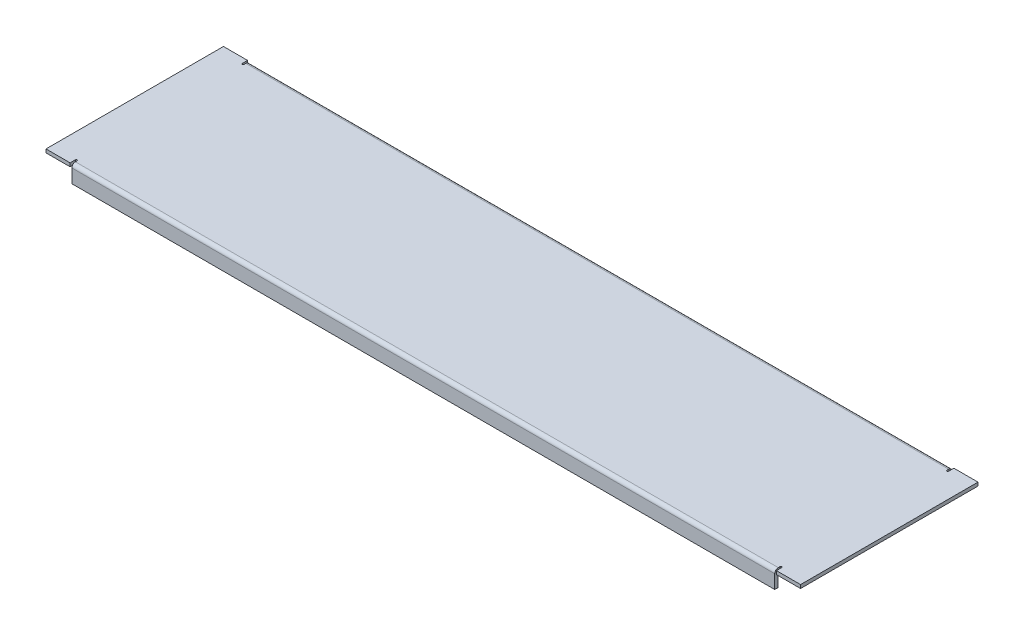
ISO-10303-21;
HEADER;
FILE_DESCRIPTION(('STEP AP214'),'2;1');
FILE_NAME('part.step','',(''),(''),'','','');
FILE_SCHEMA(('AUTOMOTIVE_DESIGN { 1 0 10303 214 1 1 1 1 }'));
ENDSEC;
DATA;
#1=APPLICATION_CONTEXT('core data for automotive mechanical design processes');
#2=APPLICATION_PROTOCOL_DEFINITION('international standard','automotive_design',2000,#1);
#3=PRODUCT_CONTEXT('',#1,'mechanical');
#4=PRODUCT('Part','Part','',(#3));
#5=PRODUCT_RELATED_PRODUCT_CATEGORY('part','',(#4));
#6=PRODUCT_DEFINITION_FORMATION('','',#4);
#7=PRODUCT_DEFINITION_CONTEXT('part definition',#1,'design');
#8=PRODUCT_DEFINITION('design','',#6,#7);
#9=PRODUCT_DEFINITION_SHAPE('','',#8);
#10=(LENGTH_UNIT() NAMED_UNIT(*) SI_UNIT(.MILLI.,.METRE.));
#11=(NAMED_UNIT(*) PLANE_ANGLE_UNIT() SI_UNIT($,.RADIAN.));
#12=(NAMED_UNIT(*) SI_UNIT($,.STERADIAN.) SOLID_ANGLE_UNIT());
#13=UNCERTAINTY_MEASURE_WITH_UNIT(LENGTH_MEASURE(1.E-05),#10,'distance_accuracy_value','');
#14=(GEOMETRIC_REPRESENTATION_CONTEXT(3) GLOBAL_UNCERTAINTY_ASSIGNED_CONTEXT((#13)) GLOBAL_UNIT_ASSIGNED_CONTEXT((#10,
#11,#12)) REPRESENTATION_CONTEXT('',''));
#15=CARTESIAN_POINT('',(0.,0.,0.));
#16=DIRECTION('',(0.,0.,1.));
#17=DIRECTION('',(1.,0.,0.));
#18=AXIS2_PLACEMENT_3D('',#15,#16,#17);
#19=CARTESIAN_POINT('',(219.,2.,-51.5));
#20=DIRECTION('',(0.,-1.,0.));
#21=DIRECTION('',(0.,0.,-1.));
#22=AXIS2_PLACEMENT_3D('',#19,#20,#21);
#23=PLANE('',#22);
#24=DIRECTION('',(0.,0.,-1.));
#25=VECTOR('',#24,1.);
#26=CARTESIAN_POINT('',(205.,2.,-51.5));
#27=LINE('',#26,#25);
#28=CARTESIAN_POINT('',(205.,2.,-48.45));
#29=VERTEX_POINT('',#28);
#30=CARTESIAN_POINT('',(205.,2.,-51.5));
#31=VERTEX_POINT('',#30);
#32=EDGE_CURVE('E89',#29,#31,#27,.T.);
#33=ORIENTED_EDGE('',*,*,#32,.F.);
#34=CARTESIAN_POINT('',(204.5,2.,-48.45));
#35=DIRECTION('',(0.,-1.,0.));
#36=DIRECTION('',(0.,0.,-1.));
#37=AXIS2_PLACEMENT_3D('',#34,#35,#36);
#38=CIRCLE('',#37,0.5);
#39=CARTESIAN_POINT('',(204.,2.,-48.45));
#40=VERTEX_POINT('',#39);
#41=EDGE_CURVE('E93',#40,#29,#38,.F.);
#42=ORIENTED_EDGE('',*,*,#41,.F.);
#43=DIRECTION('',(0.,0.,1.));
#44=VECTOR('',#43,1.);
#45=CARTESIAN_POINT('',(204.,2.,-51.5));
#46=LINE('',#45,#44);
#47=CARTESIAN_POINT('',(204.,2.00000000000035,-49.45));
#48=VERTEX_POINT('',#47);
#49=EDGE_CURVE('E373',#48,#40,#46,.T.);
#50=ORIENTED_EDGE('',*,*,#49,.F.);
#51=DIRECTION('',(1.,0.,0.));
#52=VECTOR('',#51,1.);
#53=CARTESIAN_POINT('',(204.,2.00000000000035,-49.45));
#54=LINE('',#53,#52);
#55=CARTESIAN_POINT('',(-204.,2.,-49.45));
#56=VERTEX_POINT('',#55);
#57=EDGE_CURVE('E266',#48,#56,#54,.F.);
#58=ORIENTED_EDGE('',*,*,#57,.T.);
#59=DIRECTION('',(0.,0.,-1.));
#60=VECTOR('',#59,1.);
#61=CARTESIAN_POINT('',(-204.,2.,-51.5));
#62=LINE('',#61,#60);
#63=CARTESIAN_POINT('',(-204.,2.,-48.45));
#64=VERTEX_POINT('',#63);
#65=EDGE_CURVE('E370',#64,#56,#62,.T.);
#66=ORIENTED_EDGE('',*,*,#65,.F.);
#67=CARTESIAN_POINT('',(-204.5,2.,-48.45));
#68=DIRECTION('',(0.,-1.,0.));
#69=DIRECTION('',(0.,0.,-1.));
#70=AXIS2_PLACEMENT_3D('',#67,#68,#69);
#71=CIRCLE('',#70,0.5);
#72=CARTESIAN_POINT('',(-205.,2.,-48.45));
#73=VERTEX_POINT('',#72);
#74=EDGE_CURVE('E367',#73,#64,#71,.F.);
#75=ORIENTED_EDGE('',*,*,#74,.F.);
#76=DIRECTION('',(0.,0.,1.));
#77=VECTOR('',#76,1.);
#78=CARTESIAN_POINT('',(-205.,2.,-51.5));
#79=LINE('',#78,#77);
#80=CARTESIAN_POINT('',(-205.,2.,-51.5));
#81=VERTEX_POINT('',#80);
#82=EDGE_CURVE('E332',#81,#73,#79,.T.);
#83=ORIENTED_EDGE('',*,*,#82,.F.);
#84=DIRECTION('',(-1.,0.,0.));
#85=VECTOR('',#84,1.);
#86=CARTESIAN_POINT('',(-219.,2.,-51.5));
#87=LINE('',#86,#85);
#88=CARTESIAN_POINT('',(-219.,2.,-51.5));
#89=VERTEX_POINT('',#88);
#90=EDGE_CURVE('E480',#81,#89,#87,.T.);
#91=ORIENTED_EDGE('',*,*,#90,.T.);
#92=DIRECTION('',(0.,0.,1.));
#93=VECTOR('',#92,1.);
#94=CARTESIAN_POINT('',(-219.,2.,51.5));
#95=LINE('',#94,#93);
#96=CARTESIAN_POINT('',(-219.,2.,51.5));
#97=VERTEX_POINT('',#96);
#98=EDGE_CURVE('E484',#89,#97,#95,.T.);
#99=ORIENTED_EDGE('',*,*,#98,.T.);
#100=DIRECTION('',(1.,0.,0.));
#101=VECTOR('',#100,1.);
#102=CARTESIAN_POINT('',(-219.,2.,51.5));
#103=LINE('',#102,#101);
#104=CARTESIAN_POINT('',(-205.,2.,51.5));
#105=VERTEX_POINT('',#104);
#106=EDGE_CURVE('E487',#97,#105,#103,.T.);
#107=ORIENTED_EDGE('',*,*,#106,.T.);
#108=DIRECTION('',(0.,0.,1.));
#109=VECTOR('',#108,1.);
#110=CARTESIAN_POINT('',(-205.,2.,-51.5));
#111=LINE('',#110,#109);
#112=CARTESIAN_POINT('',(-205.,2.,48.45));
#113=VERTEX_POINT('',#112);
#114=EDGE_CURVE('E474',#113,#105,#111,.T.);
#115=ORIENTED_EDGE('',*,*,#114,.F.);
#116=CARTESIAN_POINT('',(-204.5,2.,48.45));
#117=DIRECTION('',(0.,-1.,0.));
#118=DIRECTION('',(0.,0.,-1.));
#119=AXIS2_PLACEMENT_3D('',#116,#117,#118);
#120=CIRCLE('',#119,0.5);
#121=CARTESIAN_POINT('',(-204.,2.,48.45));
#122=VERTEX_POINT('',#121);
#123=EDGE_CURVE('E472',#122,#113,#120,.F.);
#124=ORIENTED_EDGE('',*,*,#123,.F.);
#125=DIRECTION('',(0.,0.,-1.));
#126=VECTOR('',#125,1.);
#127=CARTESIAN_POINT('',(-204.,2.,-51.5));
#128=LINE('',#127,#126);
#129=CARTESIAN_POINT('',(-204.,2.,49.45));
#130=VERTEX_POINT('',#129);
#131=EDGE_CURVE('E470',#130,#122,#128,.T.);
#132=ORIENTED_EDGE('',*,*,#131,.F.);
#133=DIRECTION('',(-1.,0.,0.));
#134=VECTOR('',#133,1.);
#135=CARTESIAN_POINT('',(-204.,2.,49.45));
#136=LINE('',#135,#134);
#137=CARTESIAN_POINT('',(204.,2.,49.45));
#138=VERTEX_POINT('',#137);
#139=EDGE_CURVE('E409',#130,#138,#136,.F.);
#140=ORIENTED_EDGE('',*,*,#139,.T.);
#141=DIRECTION('',(0.,0.,1.));
#142=VECTOR('',#141,1.);
#143=CARTESIAN_POINT('',(204.,2.,-51.5));
#144=LINE('',#143,#142);
#145=CARTESIAN_POINT('',(204.,2.,48.45));
#146=VERTEX_POINT('',#145);
#147=EDGE_CURVE('E468',#146,#138,#144,.T.);
#148=ORIENTED_EDGE('',*,*,#147,.F.);
#149=CARTESIAN_POINT('',(204.5,2.,48.45));
#150=DIRECTION('',(0.,-1.,0.));
#151=DIRECTION('',(0.,0.,-1.));
#152=AXIS2_PLACEMENT_3D('',#149,#150,#151);
#153=CIRCLE('',#152,0.5);
#154=CARTESIAN_POINT('',(205.,2.,48.45));
#155=VERTEX_POINT('',#154);
#156=EDGE_CURVE('E466',#155,#146,#153,.F.);
#157=ORIENTED_EDGE('',*,*,#156,.F.);
#158=DIRECTION('',(0.,0.,-1.));
#159=VECTOR('',#158,1.);
#160=CARTESIAN_POINT('',(205.,2.,-51.5));
#161=LINE('',#160,#159);
#162=CARTESIAN_POINT('',(205.,2.,51.5));
#163=VERTEX_POINT('',#162);
#164=EDGE_CURVE('E436',#163,#155,#161,.T.);
#165=ORIENTED_EDGE('',*,*,#164,.F.);
#166=CARTESIAN_POINT('',(219.,2.,51.5));
#167=VERTEX_POINT('',#166);
#168=EDGE_CURVE('E486',#163,#167,#103,.T.);
#169=ORIENTED_EDGE('',*,*,#168,.T.);
#170=DIRECTION('',(0.,0.,-1.));
#171=VECTOR('',#170,1.);
#172=CARTESIAN_POINT('',(219.,2.,51.5));
#173=LINE('',#172,#171);
#174=CARTESIAN_POINT('',(219.,2.,-51.5));
#175=VERTEX_POINT('',#174);
#176=EDGE_CURVE('E477',#167,#175,#173,.T.);
#177=ORIENTED_EDGE('',*,*,#176,.T.);
#178=EDGE_CURVE('E482',#175,#31,#87,.T.);
#179=ORIENTED_EDGE('',*,*,#178,.T.);
#180=EDGE_LOOP('',(#33,#42,#50,#58,#66,#75,#83,#91,#99,#107,#115,#124,#132,#140,#148,#157,#165,
#169,#177,#179));
#181=FACE_BOUND('',#180,.T.);
#182=ADVANCED_FACE('F74',(#181),#23,.F.);
#183=CARTESIAN_POINT('',(219.,0.,-51.5));
#184=DIRECTION('',(0.,-1.,0.));
#185=DIRECTION('',(0.,0.,-1.));
#186=AXIS2_PLACEMENT_3D('',#183,#184,#185);
#187=PLANE('',#186);
#188=CARTESIAN_POINT('',(204.5,3.53531223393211E-13,-48.45));
#189=DIRECTION('',(0.,-1.,0.));
#190=DIRECTION('',(0.,0.,-1.));
#191=AXIS2_PLACEMENT_3D('',#188,#189,#190);
#192=CIRCLE('',#191,0.5);
#193=CARTESIAN_POINT('',(205.,0.,-48.45));
#194=VERTEX_POINT('',#193);
#195=CARTESIAN_POINT('',(204.,0.,-48.45));
#196=VERTEX_POINT('',#195);
#197=EDGE_CURVE('E334',#194,#196,#192,.T.);
#198=ORIENTED_EDGE('',*,*,#197,.F.);
#199=DIRECTION('',(0.,0.,1.));
#200=VECTOR('',#199,1.);
#201=CARTESIAN_POINT('',(205.,1.76765611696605E-13,-51.5));
#202=LINE('',#201,#200);
#203=CARTESIAN_POINT('',(205.,0.,-51.5));
#204=VERTEX_POINT('',#203);
#205=EDGE_CURVE('E329',#204,#194,#202,.T.);
#206=ORIENTED_EDGE('',*,*,#205,.F.);
#207=DIRECTION('',(-1.,0.,0.));
#208=VECTOR('',#207,1.);
#209=CARTESIAN_POINT('',(-219.,0.,-51.5));
#210=LINE('',#209,#208);
#211=CARTESIAN_POINT('',(219.,0.,-51.5));
#212=VERTEX_POINT('',#211);
#213=EDGE_CURVE('E494',#212,#204,#210,.T.);
#214=ORIENTED_EDGE('',*,*,#213,.F.);
#215=DIRECTION('',(0.,0.,-1.));
#216=VECTOR('',#215,1.);
#217=CARTESIAN_POINT('',(219.,0.,51.5));
#218=LINE('',#217,#216);
#219=CARTESIAN_POINT('',(219.,0.,51.5));
#220=VERTEX_POINT('',#219);
#221=EDGE_CURVE('E476',#220,#212,#218,.T.);
#222=ORIENTED_EDGE('',*,*,#221,.F.);
#223=DIRECTION('',(1.,0.,0.));
#224=VECTOR('',#223,1.);
#225=CARTESIAN_POINT('',(-219.,0.,51.5));
#226=LINE('',#225,#224);
#227=CARTESIAN_POINT('',(205.,0.,51.5));
#228=VERTEX_POINT('',#227);
#229=EDGE_CURVE('E499',#228,#220,#226,.T.);
#230=ORIENTED_EDGE('',*,*,#229,.F.);
#231=DIRECTION('',(0.,0.,1.));
#232=VECTOR('',#231,1.);
#233=CARTESIAN_POINT('',(205.,0.,48.45));
#234=LINE('',#233,#232);
#235=CARTESIAN_POINT('',(205.,0.,48.45));
#236=VERTEX_POINT('',#235);
#237=EDGE_CURVE('E451',#236,#228,#234,.T.);
#238=ORIENTED_EDGE('',*,*,#237,.F.);
#239=CARTESIAN_POINT('',(204.5,0.,48.45));
#240=DIRECTION('',(0.,-1.,0.));
#241=DIRECTION('',(0.,0.,-1.));
#242=AXIS2_PLACEMENT_3D('',#239,#240,#241);
#243=CIRCLE('',#242,0.5);
#244=CARTESIAN_POINT('',(204.,0.,48.45));
#245=VERTEX_POINT('',#244);
#246=EDGE_CURVE('E448',#245,#236,#243,.T.);
#247=ORIENTED_EDGE('',*,*,#246,.F.);
#248=DIRECTION('',(0.,0.,-1.));
#249=VECTOR('',#248,1.);
#250=CARTESIAN_POINT('',(204.,0.,49.45));
#251=LINE('',#250,#249);
#252=CARTESIAN_POINT('',(204.,0.,49.45));
#253=VERTEX_POINT('',#252);
#254=EDGE_CURVE('E445',#253,#245,#251,.T.);
#255=ORIENTED_EDGE('',*,*,#254,.F.);
#256=DIRECTION('',(-1.,0.,0.));
#257=VECTOR('',#256,1.);
#258=CARTESIAN_POINT('',(-204.,0.,49.45));
#259=LINE('',#258,#257);
#260=CARTESIAN_POINT('',(-204.,0.,49.45));
#261=VERTEX_POINT('',#260);
#262=EDGE_CURVE('E422',#261,#253,#259,.F.);
#263=ORIENTED_EDGE('',*,*,#262,.F.);
#264=DIRECTION('',(0.,0.,1.));
#265=VECTOR('',#264,1.);
#266=CARTESIAN_POINT('',(-204.,0.,48.45));
#267=LINE('',#266,#265);
#268=CARTESIAN_POINT('',(-204.,0.,48.45));
#269=VERTEX_POINT('',#268);
#270=EDGE_CURVE('E442',#269,#261,#267,.T.);
#271=ORIENTED_EDGE('',*,*,#270,.F.);
#272=CARTESIAN_POINT('',(-204.5,0.,48.45));
#273=DIRECTION('',(0.,-1.,0.));
#274=DIRECTION('',(0.,0.,-1.));
#275=AXIS2_PLACEMENT_3D('',#272,#273,#274);
#276=CIRCLE('',#275,0.5);
#277=CARTESIAN_POINT('',(-205.,0.,48.45));
#278=VERTEX_POINT('',#277);
#279=EDGE_CURVE('E438',#278,#269,#276,.T.);
#280=ORIENTED_EDGE('',*,*,#279,.F.);
#281=DIRECTION('',(0.,0.,-1.));
#282=VECTOR('',#281,1.);
#283=CARTESIAN_POINT('',(-205.,0.,51.5));
#284=LINE('',#283,#282);
#285=CARTESIAN_POINT('',(-205.,0.,51.5));
#286=VERTEX_POINT('',#285);
#287=EDGE_CURVE('E433',#286,#278,#284,.T.);
#288=ORIENTED_EDGE('',*,*,#287,.F.);
#289=CARTESIAN_POINT('',(-219.,0.,51.5));
#290=VERTEX_POINT('',#289);
#291=EDGE_CURVE('E481',#290,#286,#226,.T.);
#292=ORIENTED_EDGE('',*,*,#291,.F.);
#293=DIRECTION('',(0.,0.,1.));
#294=VECTOR('',#293,1.);
#295=CARTESIAN_POINT('',(-219.,0.,51.5));
#296=LINE('',#295,#294);
#297=CARTESIAN_POINT('',(-219.,0.,-51.5));
#298=VERTEX_POINT('',#297);
#299=EDGE_CURVE('E497',#298,#290,#296,.T.);
#300=ORIENTED_EDGE('',*,*,#299,.F.);
#301=CARTESIAN_POINT('',(-205.,0.,-51.5));
#302=VERTEX_POINT('',#301);
#303=EDGE_CURVE('E493',#302,#298,#210,.T.);
#304=ORIENTED_EDGE('',*,*,#303,.F.);
#305=DIRECTION('',(0.,0.,-1.));
#306=VECTOR('',#305,1.);
#307=CARTESIAN_POINT('',(-205.,3.53531223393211E-13,-48.45));
#308=LINE('',#307,#306);
#309=CARTESIAN_POINT('',(-205.,0.,-48.45));
#310=VERTEX_POINT('',#309);
#311=EDGE_CURVE('E349',#310,#302,#308,.T.);
#312=ORIENTED_EDGE('',*,*,#311,.F.);
#313=CARTESIAN_POINT('',(-204.5,3.53531223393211E-13,-48.45));
#314=DIRECTION('',(0.,-1.,0.));
#315=DIRECTION('',(0.,0.,-1.));
#316=AXIS2_PLACEMENT_3D('',#313,#314,#315);
#317=CIRCLE('',#316,0.5);
#318=CARTESIAN_POINT('',(-204.,0.,-48.45));
#319=VERTEX_POINT('',#318);
#320=EDGE_CURVE('E345',#319,#310,#317,.T.);
#321=ORIENTED_EDGE('',*,*,#320,.F.);
#322=DIRECTION('',(0.,0.,1.));
#323=VECTOR('',#322,1.);
#324=CARTESIAN_POINT('',(-204.,3.53531223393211E-13,-49.45));
#325=LINE('',#324,#323);
#326=CARTESIAN_POINT('',(-204.,0.,-49.45));
#327=VERTEX_POINT('',#326);
#328=EDGE_CURVE('E342',#327,#319,#325,.T.);
#329=ORIENTED_EDGE('',*,*,#328,.F.);
#330=DIRECTION('',(1.,0.,0.));
#331=VECTOR('',#330,1.);
#332=CARTESIAN_POINT('',(204.,3.53531223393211E-13,-49.45));
#333=LINE('',#332,#331);
#334=CARTESIAN_POINT('',(204.,0.,-49.45));
#335=VERTEX_POINT('',#334);
#336=EDGE_CURVE('E320',#335,#327,#333,.F.);
#337=ORIENTED_EDGE('',*,*,#336,.F.);
#338=DIRECTION('',(0.,0.,-1.));
#339=VECTOR('',#338,1.);
#340=CARTESIAN_POINT('',(204.,3.53531223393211E-13,-48.45));
#341=LINE('',#340,#339);
#342=EDGE_CURVE('E338',#196,#335,#341,.T.);
#343=ORIENTED_EDGE('',*,*,#342,.F.);
#344=EDGE_LOOP('',(#198,#206,#214,#222,#230,#238,#247,#255,#263,#271,#280,#288,#292,#300,#304,
#312,#321,#329,#337,#343));
#345=FACE_BOUND('',#344,.T.);
#346=ADVANCED_FACE('F517',(#345),#187,.T.);
#347=CARTESIAN_POINT('',(-219.,2.,-51.5));
#348=DIRECTION('',(0.,0.,1.));
#349=DIRECTION('',(1.,0.,0.));
#350=AXIS2_PLACEMENT_3D('',#347,#348,#349);
#351=PLANE('',#350);
#352=DIRECTION('',(0.,1.,0.));
#353=VECTOR('',#352,1.);
#354=CARTESIAN_POINT('',(205.,1.76765611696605E-13,-51.5));
#355=LINE('',#354,#353);
#356=EDGE_CURVE('E333',#204,#31,#355,.T.);
#357=ORIENTED_EDGE('',*,*,#356,.T.);
#358=ORIENTED_EDGE('',*,*,#178,.F.);
#359=DIRECTION('',(0.,-1.,0.));
#360=VECTOR('',#359,1.);
#361=CARTESIAN_POINT('',(219.,2.,-51.5));
#362=LINE('',#361,#360);
#363=EDGE_CURVE('E13',#175,#212,#362,.T.);
#364=ORIENTED_EDGE('',*,*,#363,.T.);
#365=ORIENTED_EDGE('',*,*,#213,.T.);
#366=EDGE_LOOP('',(#357,#358,#364,#365));
#367=FACE_BOUND('',#366,.T.);
#368=ADVANCED_FACE('F564',(#367),#351,.F.);
#369=DIRECTION('',(0.,1.,0.));
#370=VECTOR('',#369,1.);
#371=CARTESIAN_POINT('',(-205.,1.76765611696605E-13,-51.5));
#372=LINE('',#371,#370);
#373=EDGE_CURVE('E352',#302,#81,#372,.T.);
#374=ORIENTED_EDGE('',*,*,#373,.F.);
#375=ORIENTED_EDGE('',*,*,#303,.T.);
#376=DIRECTION('',(0.,-1.,0.));
#377=VECTOR('',#376,1.);
#378=CARTESIAN_POINT('',(-219.,2.,-51.5));
#379=LINE('',#378,#377);
#380=EDGE_CURVE('E82',#89,#298,#379,.T.);
#381=ORIENTED_EDGE('',*,*,#380,.F.);
#382=ORIENTED_EDGE('',*,*,#90,.F.);
#383=EDGE_LOOP('',(#374,#375,#381,#382));
#384=FACE_BOUND('',#383,.T.);
#385=ADVANCED_FACE('F526',(#384),#351,.F.);
#386=CARTESIAN_POINT('',(-219.,2.,51.5));
#387=DIRECTION('',(0.,0.,-1.));
#388=DIRECTION('',(-1.,0.,0.));
#389=AXIS2_PLACEMENT_3D('',#386,#387,#388);
#390=PLANE('',#389);
#391=DIRECTION('',(0.,1.,0.));
#392=VECTOR('',#391,1.);
#393=CARTESIAN_POINT('',(-205.,0.,51.5));
#394=LINE('',#393,#392);
#395=EDGE_CURVE('E437',#286,#105,#394,.T.);
#396=ORIENTED_EDGE('',*,*,#395,.T.);
#397=ORIENTED_EDGE('',*,*,#106,.F.);
#398=DIRECTION('',(0.,-1.,0.));
#399=VECTOR('',#398,1.);
#400=CARTESIAN_POINT('',(-219.,2.,51.5));
#401=LINE('',#400,#399);
#402=EDGE_CURVE('E504',#97,#290,#401,.T.);
#403=ORIENTED_EDGE('',*,*,#402,.T.);
#404=ORIENTED_EDGE('',*,*,#291,.T.);
#405=EDGE_LOOP('',(#396,#397,#403,#404));
#406=FACE_BOUND('',#405,.T.);
#407=ADVANCED_FACE('F521',(#406),#390,.F.);
#408=DIRECTION('',(0.,1.,0.));
#409=VECTOR('',#408,1.);
#410=CARTESIAN_POINT('',(205.,0.,51.5));
#411=LINE('',#410,#409);
#412=EDGE_CURVE('E453',#228,#163,#411,.T.);
#413=ORIENTED_EDGE('',*,*,#412,.F.);
#414=ORIENTED_EDGE('',*,*,#229,.T.);
#415=DIRECTION('',(0.,-1.,0.));
#416=VECTOR('',#415,1.);
#417=CARTESIAN_POINT('',(219.,2.,51.5));
#418=LINE('',#417,#416);
#419=EDGE_CURVE('E490',#167,#220,#418,.T.);
#420=ORIENTED_EDGE('',*,*,#419,.F.);
#421=ORIENTED_EDGE('',*,*,#168,.F.);
#422=EDGE_LOOP('',(#413,#414,#420,#421));
#423=FACE_BOUND('',#422,.T.);
#424=ADVANCED_FACE('F572',(#423),#390,.F.);
#425=CARTESIAN_POINT('',(219.,2.,51.5));
#426=DIRECTION('',(-1.,0.,0.));
#427=DIRECTION('',(0.,0.,1.));
#428=AXIS2_PLACEMENT_3D('',#425,#426,#427);
#429=PLANE('',#428);
#430=ORIENTED_EDGE('',*,*,#221,.T.);
#431=ORIENTED_EDGE('',*,*,#363,.F.);
#432=ORIENTED_EDGE('',*,*,#176,.F.);
#433=ORIENTED_EDGE('',*,*,#419,.T.);
#434=EDGE_LOOP('',(#430,#431,#432,#433));
#435=FACE_BOUND('',#434,.T.);
#436=ADVANCED_FACE('F76',(#435),#429,.F.);
#437=CARTESIAN_POINT('',(-219.,2.,51.5));
#438=DIRECTION('',(1.,0.,0.));
#439=DIRECTION('',(0.,0.,-1.));
#440=AXIS2_PLACEMENT_3D('',#437,#438,#439);
#441=PLANE('',#440);
#442=ORIENTED_EDGE('',*,*,#299,.T.);
#443=ORIENTED_EDGE('',*,*,#402,.F.);
#444=ORIENTED_EDGE('',*,*,#98,.F.);
#445=ORIENTED_EDGE('',*,*,#380,.T.);
#446=EDGE_LOOP('',(#442,#443,#444,#445));
#447=FACE_BOUND('',#446,.T.);
#448=ADVANCED_FACE('F511',(#447),#441,.F.);
#449=CARTESIAN_POINT('',(-205.,0.,51.5));
#450=DIRECTION('',(1.,0.,0.));
#451=DIRECTION('',(0.,0.,-1.));
#452=AXIS2_PLACEMENT_3D('',#449,#450,#451);
#453=PLANE('',#452);
#454=DIRECTION('',(0.,1.,0.));
#455=VECTOR('',#454,1.);
#456=CARTESIAN_POINT('',(-205.,0.,48.45));
#457=LINE('',#456,#455);
#458=EDGE_CURVE('E441',#278,#113,#457,.T.);
#459=ORIENTED_EDGE('',*,*,#458,.T.);
#460=ORIENTED_EDGE('',*,*,#114,.T.);
#461=ORIENTED_EDGE('',*,*,#395,.F.);
#462=ORIENTED_EDGE('',*,*,#287,.T.);
#463=EDGE_LOOP('',(#459,#460,#461,#462));
#464=FACE_BOUND('',#463,.T.);
#465=ADVANCED_FACE('F567',(#464),#453,.T.);
#466=CARTESIAN_POINT('',(-204.5,0.,48.45));
#467=DIRECTION('',(0.,1.,0.));
#468=DIRECTION('',(0.,0.,1.));
#469=AXIS2_PLACEMENT_3D('',#466,#467,#468);
#470=CYLINDRICAL_SURFACE('',#469,0.5);
#471=DIRECTION('',(0.,1.,0.));
#472=VECTOR('',#471,1.);
#473=CARTESIAN_POINT('',(-204.,0.,48.45));
#474=LINE('',#473,#472);
#475=EDGE_CURVE('E444',#269,#122,#474,.T.);
#476=ORIENTED_EDGE('',*,*,#475,.T.);
#477=ORIENTED_EDGE('',*,*,#123,.T.);
#478=ORIENTED_EDGE('',*,*,#458,.F.);
#479=ORIENTED_EDGE('',*,*,#279,.T.);
#480=EDGE_LOOP('',(#476,#477,#478,#479));
#481=FACE_BOUND('',#480,.T.);
#482=ADVANCED_FACE('F665',(#481),#470,.F.);
#483=CARTESIAN_POINT('',(-204.,0.,48.45));
#484=DIRECTION('',(-1.,0.,0.));
#485=DIRECTION('',(0.,0.,1.));
#486=AXIS2_PLACEMENT_3D('',#483,#484,#485);
#487=PLANE('',#486);
#488=DIRECTION('',(0.,1.,0.));
#489=VECTOR('',#488,1.);
#490=CARTESIAN_POINT('',(-204.,0.,49.45));
#491=LINE('',#490,#489);
#492=EDGE_CURVE('E416',#261,#130,#491,.T.);
#493=ORIENTED_EDGE('',*,*,#492,.T.);
#494=ORIENTED_EDGE('',*,*,#131,.T.);
#495=ORIENTED_EDGE('',*,*,#475,.F.);
#496=ORIENTED_EDGE('',*,*,#270,.T.);
#497=EDGE_LOOP('',(#493,#494,#495,#496));
#498=FACE_BOUND('',#497,.T.);
#499=ADVANCED_FACE('F641',(#498),#487,.T.);
#500=CARTESIAN_POINT('',(204.,0.,49.45));
#501=DIRECTION('',(1.,0.,0.));
#502=DIRECTION('',(0.,0.,-1.));
#503=AXIS2_PLACEMENT_3D('',#500,#501,#502);
#504=PLANE('',#503);
#505=DIRECTION('',(0.,1.,0.));
#506=VECTOR('',#505,1.);
#507=CARTESIAN_POINT('',(204.,0.,48.45));
#508=LINE('',#507,#506);
#509=EDGE_CURVE('E450',#245,#146,#508,.T.);
#510=ORIENTED_EDGE('',*,*,#509,.T.);
#511=ORIENTED_EDGE('',*,*,#147,.T.);
#512=DIRECTION('',(0.,1.,0.));
#513=VECTOR('',#512,1.);
#514=CARTESIAN_POINT('',(204.,0.,49.45));
#515=LINE('',#514,#513);
#516=EDGE_CURVE('E427',#253,#138,#515,.T.);
#517=ORIENTED_EDGE('',*,*,#516,.F.);
#518=ORIENTED_EDGE('',*,*,#254,.T.);
#519=EDGE_LOOP('',(#510,#511,#517,#518));
#520=FACE_BOUND('',#519,.T.);
#521=ADVANCED_FACE('F610',(#520),#504,.T.);
#522=CARTESIAN_POINT('',(204.5,0.,48.45));
#523=DIRECTION('',(0.,1.,0.));
#524=DIRECTION('',(0.,0.,1.));
#525=AXIS2_PLACEMENT_3D('',#522,#523,#524);
#526=CYLINDRICAL_SURFACE('',#525,0.5);
#527=DIRECTION('',(0.,1.,0.));
#528=VECTOR('',#527,1.);
#529=CARTESIAN_POINT('',(205.,0.,48.45));
#530=LINE('',#529,#528);
#531=EDGE_CURVE('E430',#236,#155,#530,.T.);
#532=ORIENTED_EDGE('',*,*,#531,.T.);
#533=ORIENTED_EDGE('',*,*,#156,.T.);
#534=ORIENTED_EDGE('',*,*,#509,.F.);
#535=ORIENTED_EDGE('',*,*,#246,.T.);
#536=EDGE_LOOP('',(#532,#533,#534,#535));
#537=FACE_BOUND('',#536,.T.);
#538=ADVANCED_FACE('F606',(#537),#526,.F.);
#539=CARTESIAN_POINT('',(205.,0.,48.45));
#540=DIRECTION('',(-1.,0.,0.));
#541=DIRECTION('',(0.,0.,1.));
#542=AXIS2_PLACEMENT_3D('',#539,#540,#541);
#543=PLANE('',#542);
#544=ORIENTED_EDGE('',*,*,#412,.T.);
#545=ORIENTED_EDGE('',*,*,#164,.T.);
#546=ORIENTED_EDGE('',*,*,#531,.F.);
#547=ORIENTED_EDGE('',*,*,#237,.T.);
#548=EDGE_LOOP('',(#544,#545,#546,#547));
#549=FACE_BOUND('',#548,.T.);
#550=ADVANCED_FACE('F602',(#549),#543,.T.);
#551=CARTESIAN_POINT('',(204.,-0.0500000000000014,49.45));
#552=DIRECTION('',(1.,0.,0.));
#553=DIRECTION('',(0.,0.,-1.));
#554=AXIS2_PLACEMENT_3D('',#551,#552,#553);
#555=PLANE('',#554);
#556=DIRECTION('',(0.,0.,1.));
#557=VECTOR('',#556,1.);
#558=CARTESIAN_POINT('',(204.,-0.0500000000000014,51.5));
#559=LINE('',#558,#557);
#560=CARTESIAN_POINT('',(204.,-0.0500000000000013,49.5));
#561=VERTEX_POINT('',#560);
#562=CARTESIAN_POINT('',(204.,-0.0499999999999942,51.5));
#563=VERTEX_POINT('',#562);
#564=EDGE_CURVE('E376',#561,#563,#559,.T.);
#565=ORIENTED_EDGE('',*,*,#564,.F.);
#566=CARTESIAN_POINT('',(204.,-0.0500000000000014,49.45));
#567=DIRECTION('',(-1.,0.,0.));
#568=DIRECTION('',(0.,0.,1.));
#569=AXIS2_PLACEMENT_3D('',#566,#567,#568);
#570=CIRCLE('',#569,0.0500000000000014);
#571=EDGE_CURVE('E419',#253,#561,#570,.F.);
#572=ORIENTED_EDGE('',*,*,#571,.F.);
#573=ORIENTED_EDGE('',*,*,#516,.T.);
#574=CARTESIAN_POINT('',(204.,-0.0500000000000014,49.45));
#575=DIRECTION('',(-1.,0.,0.));
#576=DIRECTION('',(0.,0.,1.));
#577=AXIS2_PLACEMENT_3D('',#574,#575,#576);
#578=CIRCLE('',#577,2.05);
#579=EDGE_CURVE('E412',#138,#563,#578,.F.);
#580=ORIENTED_EDGE('',*,*,#579,.T.);
#581=EDGE_LOOP('',(#565,#572,#573,#580));
#582=FACE_BOUND('',#581,.T.);
#583=ADVANCED_FACE('F620',(#582),#555,.T.);
#584=CARTESIAN_POINT('',(-204.,-0.0500000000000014,49.45));
#585=DIRECTION('',(1.,0.,0.));
#586=DIRECTION('',(0.,0.,-1.));
#587=AXIS2_PLACEMENT_3D('',#584,#585,#586);
#588=PLANE('',#587);
#589=CARTESIAN_POINT('',(-204.,-0.0500000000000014,49.45));
#590=DIRECTION('',(-1.,0.,0.));
#591=DIRECTION('',(0.,0.,1.));
#592=AXIS2_PLACEMENT_3D('',#589,#590,#591);
#593=CIRCLE('',#592,0.0500000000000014);
#594=CARTESIAN_POINT('',(-204.,-0.0500000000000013,49.5));
#595=VERTEX_POINT('',#594);
#596=EDGE_CURVE('E380',#595,#261,#593,.T.);
#597=ORIENTED_EDGE('',*,*,#596,.F.);
#598=DIRECTION('',(0.,0.,1.));
#599=VECTOR('',#598,1.);
#600=CARTESIAN_POINT('',(-204.,-0.0500000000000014,49.5));
#601=LINE('',#600,#599);
#602=CARTESIAN_POINT('',(-204.,-0.0500000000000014,51.5));
#603=VERTEX_POINT('',#602);
#604=EDGE_CURVE('E402',#595,#603,#601,.T.);
#605=ORIENTED_EDGE('',*,*,#604,.T.);
#606=CARTESIAN_POINT('',(-204.,-0.0500000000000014,49.45));
#607=DIRECTION('',(-1.,0.,0.));
#608=DIRECTION('',(0.,0.,1.));
#609=AXIS2_PLACEMENT_3D('',#606,#607,#608);
#610=CIRCLE('',#609,2.05);
#611=EDGE_CURVE('E413',#603,#130,#610,.T.);
#612=ORIENTED_EDGE('',*,*,#611,.T.);
#613=ORIENTED_EDGE('',*,*,#492,.F.);
#614=EDGE_LOOP('',(#597,#605,#612,#613));
#615=FACE_BOUND('',#614,.T.);
#616=ADVANCED_FACE('F639',(#615),#588,.F.);
#617=CARTESIAN_POINT('',(-204.,-0.0500000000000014,49.45));
#618=DIRECTION('',(-1.,0.,0.));
#619=DIRECTION('',(0.,0.,1.));
#620=AXIS2_PLACEMENT_3D('',#617,#618,#619);
#621=CYLINDRICAL_SURFACE('',#620,2.05);
#622=ORIENTED_EDGE('',*,*,#139,.F.);
#623=ORIENTED_EDGE('',*,*,#611,.F.);
#624=DIRECTION('',(-1.,0.,0.));
#625=VECTOR('',#624,1.);
#626=CARTESIAN_POINT('',(204.,-0.0500000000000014,51.5));
#627=LINE('',#626,#625);
#628=EDGE_CURVE('E399',#563,#603,#627,.T.);
#629=ORIENTED_EDGE('',*,*,#628,.F.);
#630=ORIENTED_EDGE('',*,*,#579,.F.);
#631=EDGE_LOOP('',(#622,#623,#629,#630));
#632=FACE_BOUND('',#631,.T.);
#633=ADVANCED_FACE('F643',(#632),#621,.T.);
#634=CARTESIAN_POINT('',(-204.,-0.0500000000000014,49.45));
#635=DIRECTION('',(-1.,0.,0.));
#636=DIRECTION('',(0.,0.,1.));
#637=AXIS2_PLACEMENT_3D('',#634,#635,#636);
#638=CYLINDRICAL_SURFACE('',#637,0.0500000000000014);
#639=ORIENTED_EDGE('',*,*,#262,.T.);
#640=ORIENTED_EDGE('',*,*,#571,.T.);
#641=DIRECTION('',(1.,0.,0.));
#642=VECTOR('',#641,1.);
#643=CARTESIAN_POINT('',(204.,-0.0500000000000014,49.5));
#644=LINE('',#643,#642);
#645=EDGE_CURVE('E405',#561,#595,#644,.F.);
#646=ORIENTED_EDGE('',*,*,#645,.T.);
#647=ORIENTED_EDGE('',*,*,#596,.T.);
#648=EDGE_LOOP('',(#639,#640,#646,#647));
#649=FACE_BOUND('',#648,.T.);
#650=ADVANCED_FACE('F616',(#649),#638,.F.);
#651=CARTESIAN_POINT('',(204.,-7.99999999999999,51.5));
#652=DIRECTION('',(1.,0.,0.));
#653=DIRECTION('',(0.,0.,-1.));
#654=AXIS2_PLACEMENT_3D('',#651,#652,#653);
#655=PLANE('',#654);
#656=DIRECTION('',(0.,1.,0.));
#657=VECTOR('',#656,1.);
#658=CARTESIAN_POINT('',(204.,-8.,49.5));
#659=LINE('',#658,#657);
#660=CARTESIAN_POINT('',(204.,-8.,49.5));
#661=VERTEX_POINT('',#660);
#662=EDGE_CURVE('E391',#561,#661,#659,.F.);
#663=ORIENTED_EDGE('',*,*,#662,.F.);
#664=ORIENTED_EDGE('',*,*,#564,.T.);
#665=DIRECTION('',(0.,-1.,0.));
#666=VECTOR('',#665,1.);
#667=CARTESIAN_POINT('',(204.,-7.99999999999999,51.5));
#668=LINE('',#667,#666);
#669=CARTESIAN_POINT('',(204.,-7.99999999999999,51.5));
#670=VERTEX_POINT('',#669);
#671=EDGE_CURVE('E383',#563,#670,#668,.T.);
#672=ORIENTED_EDGE('',*,*,#671,.T.);
#673=DIRECTION('',(0.,0.,-1.));
#674=VECTOR('',#673,1.);
#675=CARTESIAN_POINT('',(204.,-7.99999999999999,51.5));
#676=LINE('',#675,#674);
#677=EDGE_CURVE('E377',#670,#661,#676,.T.);
#678=ORIENTED_EDGE('',*,*,#677,.T.);
#679=EDGE_LOOP('',(#663,#664,#672,#678));
#680=FACE_BOUND('',#679,.T.);
#681=ADVANCED_FACE('F625',(#680),#655,.T.);
#682=CARTESIAN_POINT('',(-204.,-7.99999999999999,51.5));
#683=DIRECTION('',(-1.,0.,0.));
#684=DIRECTION('',(0.,0.,1.));
#685=AXIS2_PLACEMENT_3D('',#682,#683,#684);
#686=PLANE('',#685);
#687=DIRECTION('',(0.,1.,0.));
#688=VECTOR('',#687,1.);
#689=CARTESIAN_POINT('',(-204.,-7.99999999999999,51.5));
#690=LINE('',#689,#688);
#691=CARTESIAN_POINT('',(-204.,-7.99999999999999,51.5));
#692=VERTEX_POINT('',#691);
#693=EDGE_CURVE('E385',#692,#603,#690,.T.);
#694=ORIENTED_EDGE('',*,*,#693,.T.);
#695=ORIENTED_EDGE('',*,*,#604,.F.);
#696=DIRECTION('',(0.,-1.,0.));
#697=VECTOR('',#696,1.);
#698=CARTESIAN_POINT('',(-204.,-8.,49.5));
#699=LINE('',#698,#697);
#700=CARTESIAN_POINT('',(-204.,-8.,49.5));
#701=VERTEX_POINT('',#700);
#702=EDGE_CURVE('E393',#701,#595,#699,.F.);
#703=ORIENTED_EDGE('',*,*,#702,.F.);
#704=DIRECTION('',(0.,0.,-1.));
#705=VECTOR('',#704,1.);
#706=CARTESIAN_POINT('',(-204.,-7.99999999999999,51.5));
#707=LINE('',#706,#705);
#708=EDGE_CURVE('E381',#692,#701,#707,.T.);
#709=ORIENTED_EDGE('',*,*,#708,.F.);
#710=EDGE_LOOP('',(#694,#695,#703,#709));
#711=FACE_BOUND('',#710,.T.);
#712=ADVANCED_FACE('F885',(#711),#686,.T.);
#713=CARTESIAN_POINT('',(204.,-7.99999999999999,51.5));
#714=DIRECTION('',(0.,0.,1.));
#715=DIRECTION('',(0.,-1.,0.));
#716=AXIS2_PLACEMENT_3D('',#713,#714,#715);
#717=PLANE('',#716);
#718=ORIENTED_EDGE('',*,*,#671,.F.);
#719=ORIENTED_EDGE('',*,*,#628,.T.);
#720=ORIENTED_EDGE('',*,*,#693,.F.);
#721=DIRECTION('',(-1.,0.,0.));
#722=VECTOR('',#721,1.);
#723=CARTESIAN_POINT('',(-204.,-7.99999999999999,51.5));
#724=LINE('',#723,#722);
#725=EDGE_CURVE('E388',#670,#692,#724,.T.);
#726=ORIENTED_EDGE('',*,*,#725,.F.);
#727=EDGE_LOOP('',(#718,#719,#720,#726));
#728=FACE_BOUND('',#727,.T.);
#729=ADVANCED_FACE('F629',(#728),#717,.T.);
#730=CARTESIAN_POINT('',(204.,-8.,49.5));
#731=DIRECTION('',(0.,0.,1.));
#732=DIRECTION('',(0.,-1.,0.));
#733=AXIS2_PLACEMENT_3D('',#730,#731,#732);
#734=PLANE('',#733);
#735=ORIENTED_EDGE('',*,*,#645,.F.);
#736=ORIENTED_EDGE('',*,*,#662,.T.);
#737=DIRECTION('',(1.,0.,0.));
#738=VECTOR('',#737,1.);
#739=CARTESIAN_POINT('',(204.,-8.,49.5));
#740=LINE('',#739,#738);
#741=EDGE_CURVE('E396',#661,#701,#740,.F.);
#742=ORIENTED_EDGE('',*,*,#741,.T.);
#743=ORIENTED_EDGE('',*,*,#702,.T.);
#744=EDGE_LOOP('',(#735,#736,#742,#743));
#745=FACE_BOUND('',#744,.T.);
#746=ADVANCED_FACE('F636',(#745),#734,.F.);
#747=CARTESIAN_POINT('',(-204.,-7.99999999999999,51.5));
#748=DIRECTION('',(0.,-1.,0.));
#749=DIRECTION('',(0.,0.,-1.));
#750=AXIS2_PLACEMENT_3D('',#747,#748,#749);
#751=PLANE('',#750);
#752=ORIENTED_EDGE('',*,*,#741,.F.);
#753=ORIENTED_EDGE('',*,*,#677,.F.);
#754=ORIENTED_EDGE('',*,*,#725,.T.);
#755=ORIENTED_EDGE('',*,*,#708,.T.);
#756=EDGE_LOOP('',(#752,#753,#754,#755));
#757=FACE_BOUND('',#756,.T.);
#758=ADVANCED_FACE('F633',(#757),#751,.T.);
#759=CARTESIAN_POINT('',(204.5,3.53531223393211E-13,-48.45));
#760=DIRECTION('',(0.,1.,0.));
#761=DIRECTION('',(0.,0.,1.));
#762=AXIS2_PLACEMENT_3D('',#759,#760,#761);
#763=CYLINDRICAL_SURFACE('',#762,0.5);
#764=DIRECTION('',(0.,1.,0.));
#765=VECTOR('',#764,1.);
#766=CARTESIAN_POINT('',(204.,3.53531223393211E-13,-48.45));
#767=LINE('',#766,#765);
#768=EDGE_CURVE('E341',#196,#40,#767,.T.);
#769=ORIENTED_EDGE('',*,*,#768,.T.);
#770=ORIENTED_EDGE('',*,*,#41,.T.);
#771=DIRECTION('',(0.,1.,0.));
#772=VECTOR('',#771,1.);
#773=CARTESIAN_POINT('',(205.,3.53531223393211E-13,-48.45));
#774=LINE('',#773,#772);
#775=EDGE_CURVE('E337',#194,#29,#774,.T.);
#776=ORIENTED_EDGE('',*,*,#775,.F.);
#777=ORIENTED_EDGE('',*,*,#197,.T.);
#778=EDGE_LOOP('',(#769,#770,#776,#777));
#779=FACE_BOUND('',#778,.T.);
#780=ADVANCED_FACE('F586',(#779),#763,.F.);
#781=CARTESIAN_POINT('',(204.,3.53531223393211E-13,-48.45));
#782=DIRECTION('',(1.,0.,0.));
#783=DIRECTION('',(0.,0.,-1.));
#784=AXIS2_PLACEMENT_3D('',#781,#782,#783);
#785=PLANE('',#784);
#786=DIRECTION('',(0.,1.,0.));
#787=VECTOR('',#786,1.);
#788=CARTESIAN_POINT('',(204.,3.53531223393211E-13,-49.45));
#789=LINE('',#788,#787);
#790=EDGE_CURVE('E316',#335,#48,#789,.T.);
#791=ORIENTED_EDGE('',*,*,#790,.T.);
#792=ORIENTED_EDGE('',*,*,#49,.T.);
#793=ORIENTED_EDGE('',*,*,#768,.F.);
#794=ORIENTED_EDGE('',*,*,#342,.T.);
#795=EDGE_LOOP('',(#791,#792,#793,#794));
#796=FACE_BOUND('',#795,.T.);
#797=ADVANCED_FACE('F589',(#796),#785,.T.);
#798=CARTESIAN_POINT('',(-204.,3.53531223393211E-13,-49.45));
#799=DIRECTION('',(-1.,0.,0.));
#800=DIRECTION('',(0.,0.,1.));
#801=AXIS2_PLACEMENT_3D('',#798,#799,#800);
#802=PLANE('',#801);
#803=DIRECTION('',(0.,1.,0.));
#804=VECTOR('',#803,1.);
#805=CARTESIAN_POINT('',(-204.,3.53531223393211E-13,-48.45));
#806=LINE('',#805,#804);
#807=EDGE_CURVE('E348',#319,#64,#806,.T.);
#808=ORIENTED_EDGE('',*,*,#807,.T.);
#809=ORIENTED_EDGE('',*,*,#65,.T.);
#810=DIRECTION('',(0.,1.,0.));
#811=VECTOR('',#810,1.);
#812=CARTESIAN_POINT('',(-204.,3.53531223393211E-13,-49.45));
#813=LINE('',#812,#811);
#814=EDGE_CURVE('E324',#327,#56,#813,.T.);
#815=ORIENTED_EDGE('',*,*,#814,.F.);
#816=ORIENTED_EDGE('',*,*,#328,.T.);
#817=EDGE_LOOP('',(#808,#809,#815,#816));
#818=FACE_BOUND('',#817,.T.);
#819=ADVANCED_FACE('F535',(#818),#802,.T.);
#820=CARTESIAN_POINT('',(-204.5,3.53531223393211E-13,-48.45));
#821=DIRECTION('',(0.,1.,0.));
#822=DIRECTION('',(0.,0.,1.));
#823=AXIS2_PLACEMENT_3D('',#820,#821,#822);
#824=CYLINDRICAL_SURFACE('',#823,0.5);
#825=DIRECTION('',(0.,1.,0.));
#826=VECTOR('',#825,1.);
#827=CARTESIAN_POINT('',(-205.,3.53531223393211E-13,-48.45));
#828=LINE('',#827,#826);
#829=EDGE_CURVE('E327',#310,#73,#828,.T.);
#830=ORIENTED_EDGE('',*,*,#829,.T.);
#831=ORIENTED_EDGE('',*,*,#74,.T.);
#832=ORIENTED_EDGE('',*,*,#807,.F.);
#833=ORIENTED_EDGE('',*,*,#320,.T.);
#834=EDGE_LOOP('',(#830,#831,#832,#833));
#835=FACE_BOUND('',#834,.T.);
#836=ADVANCED_FACE('F533',(#835),#824,.F.);
#837=CARTESIAN_POINT('',(205.,1.76765611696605E-13,-51.5));
#838=DIRECTION('',(-1.,0.,0.));
#839=DIRECTION('',(0.,0.,1.));
#840=AXIS2_PLACEMENT_3D('',#837,#838,#839);
#841=PLANE('',#840);
#842=ORIENTED_EDGE('',*,*,#775,.T.);
#843=ORIENTED_EDGE('',*,*,#32,.T.);
#844=ORIENTED_EDGE('',*,*,#356,.F.);
#845=ORIENTED_EDGE('',*,*,#205,.T.);
#846=EDGE_LOOP('',(#842,#843,#844,#845));
#847=FACE_BOUND('',#846,.T.);
#848=ADVANCED_FACE('F583',(#847),#841,.T.);
#849=CARTESIAN_POINT('',(-205.,3.53531223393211E-13,-48.45));
#850=DIRECTION('',(1.,0.,0.));
#851=DIRECTION('',(0.,0.,-1.));
#852=AXIS2_PLACEMENT_3D('',#849,#850,#851);
#853=PLANE('',#852);
#854=ORIENTED_EDGE('',*,*,#373,.T.);
#855=ORIENTED_EDGE('',*,*,#82,.T.);
#856=ORIENTED_EDGE('',*,*,#829,.F.);
#857=ORIENTED_EDGE('',*,*,#311,.T.);
#858=EDGE_LOOP('',(#854,#855,#856,#857));
#859=FACE_BOUND('',#858,.T.);
#860=ADVANCED_FACE('F528',(#859),#853,.T.);
#861=CARTESIAN_POINT('',(-204.,-0.0499999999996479,-49.45));
#862=DIRECTION('',(-1.,0.,0.));
#863=DIRECTION('',(0.,0.,1.));
#864=AXIS2_PLACEMENT_3D('',#861,#862,#863);
#865=PLANE('',#864);
#866=DIRECTION('',(0.,0.,-1.));
#867=VECTOR('',#866,1.);
#868=CARTESIAN_POINT('',(-204.,-0.0499999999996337,-51.5));
#869=LINE('',#868,#867);
#870=CARTESIAN_POINT('',(-204.,-0.0499999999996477,-49.5));
#871=VERTEX_POINT('',#870);
#872=CARTESIAN_POINT('',(-204.,-0.0499999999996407,-51.5));
#873=VERTEX_POINT('',#872);
#874=EDGE_CURVE('E311',#871,#873,#869,.T.);
#875=ORIENTED_EDGE('',*,*,#874,.F.);
#876=CARTESIAN_POINT('',(-204.,-0.0499999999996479,-49.45));
#877=DIRECTION('',(1.,0.,0.));
#878=DIRECTION('',(0.,0.,-1.));
#879=AXIS2_PLACEMENT_3D('',#876,#877,#878);
#880=CIRCLE('',#879,0.0500000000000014);
#881=EDGE_CURVE('E269',#327,#871,#880,.F.);
#882=ORIENTED_EDGE('',*,*,#881,.F.);
#883=ORIENTED_EDGE('',*,*,#814,.T.);
#884=CARTESIAN_POINT('',(-204.,-0.0499999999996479,-49.45));
#885=DIRECTION('',(1.,0.,0.));
#886=DIRECTION('',(0.,0.,-1.));
#887=AXIS2_PLACEMENT_3D('',#884,#885,#886);
#888=CIRCLE('',#887,2.05);
#889=EDGE_CURVE('E315',#56,#873,#888,.F.);
#890=ORIENTED_EDGE('',*,*,#889,.T.);
#891=EDGE_LOOP('',(#875,#882,#883,#890));
#892=FACE_BOUND('',#891,.T.);
#893=ADVANCED_FACE('F541',(#892),#865,.T.);
#894=CARTESIAN_POINT('',(204.,-0.0499999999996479,-49.45));
#895=DIRECTION('',(-1.,0.,0.));
#896=DIRECTION('',(0.,0.,1.));
#897=AXIS2_PLACEMENT_3D('',#894,#895,#896);
#898=PLANE('',#897);
#899=CARTESIAN_POINT('',(204.,-0.0499999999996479,-49.45));
#900=DIRECTION('',(1.,0.,0.));
#901=DIRECTION('',(0.,0.,-1.));
#902=AXIS2_PLACEMENT_3D('',#899,#900,#901);
#903=CIRCLE('',#902,0.0500000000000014);
#904=CARTESIAN_POINT('',(204.,-0.0499999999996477,-49.5));
#905=VERTEX_POINT('',#904);
#906=EDGE_CURVE('E276',#905,#335,#903,.T.);
#907=ORIENTED_EDGE('',*,*,#906,.F.);
#908=DIRECTION('',(0.,0.,-1.));
#909=VECTOR('',#908,1.);
#910=CARTESIAN_POINT('',(204.,-0.0499999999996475,-49.5));
#911=LINE('',#910,#909);
#912=CARTESIAN_POINT('',(204.,-0.0499999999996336,-51.5));
#913=VERTEX_POINT('',#912);
#914=EDGE_CURVE('E273',#905,#913,#911,.T.);
#915=ORIENTED_EDGE('',*,*,#914,.T.);
#916=CARTESIAN_POINT('',(204.,-0.0499999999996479,-49.45));
#917=DIRECTION('',(1.,0.,0.));
#918=DIRECTION('',(0.,0.,-1.));
#919=AXIS2_PLACEMENT_3D('',#916,#917,#918);
#920=CIRCLE('',#919,2.05);
#921=EDGE_CURVE('E259',#913,#48,#920,.T.);
#922=ORIENTED_EDGE('',*,*,#921,.T.);
#923=ORIENTED_EDGE('',*,*,#790,.F.);
#924=EDGE_LOOP('',(#907,#915,#922,#923));
#925=FACE_BOUND('',#924,.T.);
#926=ADVANCED_FACE('F274',(#925),#898,.F.);
#927=CARTESIAN_POINT('',(204.,-0.0499999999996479,-49.45));
#928=DIRECTION('',(1.,0.,0.));
#929=DIRECTION('',(0.,0.,-1.));
#930=AXIS2_PLACEMENT_3D('',#927,#928,#929);
#931=CYLINDRICAL_SURFACE('',#930,2.05);
#932=ORIENTED_EDGE('',*,*,#57,.F.);
#933=ORIENTED_EDGE('',*,*,#921,.F.);
#934=DIRECTION('',(1.,0.,0.));
#935=VECTOR('',#934,1.);
#936=CARTESIAN_POINT('',(-204.,-0.0499999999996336,-51.5));
#937=LINE('',#936,#935);
#938=EDGE_CURVE('E264',#873,#913,#937,.T.);
#939=ORIENTED_EDGE('',*,*,#938,.F.);
#940=ORIENTED_EDGE('',*,*,#889,.F.);
#941=EDGE_LOOP('',(#932,#933,#939,#940));
#942=FACE_BOUND('',#941,.T.);
#943=ADVANCED_FACE('F261',(#942),#931,.T.);
#944=CARTESIAN_POINT('',(204.,-0.0499999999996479,-49.45));
#945=DIRECTION('',(1.,0.,0.));
#946=DIRECTION('',(0.,0.,-1.));
#947=AXIS2_PLACEMENT_3D('',#944,#945,#946);
#948=CYLINDRICAL_SURFACE('',#947,0.0500000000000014);
#949=ORIENTED_EDGE('',*,*,#336,.T.);
#950=ORIENTED_EDGE('',*,*,#881,.T.);
#951=DIRECTION('',(-1.,0.,0.));
#952=VECTOR('',#951,1.);
#953=CARTESIAN_POINT('',(-204.,-0.0499999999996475,-49.5));
#954=LINE('',#953,#952);
#955=EDGE_CURVE('E281',#871,#905,#954,.F.);
#956=ORIENTED_EDGE('',*,*,#955,.T.);
#957=ORIENTED_EDGE('',*,*,#906,.T.);
#958=EDGE_LOOP('',(#949,#950,#956,#957));
#959=FACE_BOUND('',#958,.T.);
#960=ADVANCED_FACE('F539',(#959),#948,.F.);
#961=CARTESIAN_POINT('',(-204.,-7.99999999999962,-51.5));
#962=DIRECTION('',(-1.,0.,0.));
#963=DIRECTION('',(0.,0.,1.));
#964=AXIS2_PLACEMENT_3D('',#961,#962,#963);
#965=PLANE('',#964);
#966=DIRECTION('',(0.,1.,0.));
#967=VECTOR('',#966,1.);
#968=CARTESIAN_POINT('',(-204.,3.52465245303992E-13,-49.5));
#969=LINE('',#968,#967);
#970=CARTESIAN_POINT('',(-204.,-7.99999999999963,-49.5));
#971=VERTEX_POINT('',#970);
#972=EDGE_CURVE('E291',#871,#971,#969,.F.);
#973=ORIENTED_EDGE('',*,*,#972,.F.);
#974=ORIENTED_EDGE('',*,*,#874,.T.);
#975=DIRECTION('',(0.,-1.,0.));
#976=VECTOR('',#975,1.);
#977=CARTESIAN_POINT('',(-204.,-7.99999999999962,-51.5));
#978=LINE('',#977,#976);
#979=CARTESIAN_POINT('',(-204.,-7.99999999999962,-51.5));
#980=VERTEX_POINT('',#979);
#981=EDGE_CURVE('E290',#873,#980,#978,.T.);
#982=ORIENTED_EDGE('',*,*,#981,.T.);
#983=DIRECTION('',(0.,0.,1.));
#984=VECTOR('',#983,1.);
#985=CARTESIAN_POINT('',(-204.,-7.99999999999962,-51.5));
#986=LINE('',#985,#984);
#987=EDGE_CURVE('E295',#980,#971,#986,.T.);
#988=ORIENTED_EDGE('',*,*,#987,.T.);
#989=EDGE_LOOP('',(#973,#974,#982,#988));
#990=FACE_BOUND('',#989,.T.);
#991=ADVANCED_FACE('F544',(#990),#965,.T.);
#992=CARTESIAN_POINT('',(204.,3.59448212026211E-13,-51.5));
#993=DIRECTION('',(1.,0.,0.));
#994=DIRECTION('',(0.,0.,-1.));
#995=AXIS2_PLACEMENT_3D('',#992,#993,#994);
#996=PLANE('',#995);
#997=DIRECTION('',(0.,1.,0.));
#998=VECTOR('',#997,1.);
#999=CARTESIAN_POINT('',(204.,3.59448212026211E-13,-51.5));
#1000=LINE('',#999,#998);
#1001=CARTESIAN_POINT('',(204.,-7.99999999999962,-51.5));
#1002=VERTEX_POINT('',#1001);
#1003=EDGE_CURVE('E288',#1002,#913,#1000,.T.);
#1004=ORIENTED_EDGE('',*,*,#1003,.T.);
#1005=ORIENTED_EDGE('',*,*,#914,.F.);
#1006=DIRECTION('',(0.,-1.,0.));
#1007=VECTOR('',#1006,1.);
#1008=CARTESIAN_POINT('',(204.,3.52465245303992E-13,-49.5));
#1009=LINE('',#1008,#1007);
#1010=CARTESIAN_POINT('',(204.,-7.99999999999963,-49.5));
#1011=VERTEX_POINT('',#1010);
#1012=EDGE_CURVE('E304',#1011,#905,#1009,.F.);
#1013=ORIENTED_EDGE('',*,*,#1012,.F.);
#1014=DIRECTION('',(0.,0.,1.));
#1015=VECTOR('',#1014,1.);
#1016=CARTESIAN_POINT('',(204.,-7.99999999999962,-51.5));
#1017=LINE('',#1016,#1015);
#1018=EDGE_CURVE('E294',#1002,#1011,#1017,.T.);
#1019=ORIENTED_EDGE('',*,*,#1018,.F.);
#1020=EDGE_LOOP('',(#1004,#1005,#1013,#1019));
#1021=FACE_BOUND('',#1020,.T.);
#1022=ADVANCED_FACE('F293',(#1021),#996,.T.);
#1023=CARTESIAN_POINT('',(-204.,3.59448212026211E-13,-51.5));
#1024=DIRECTION('',(0.,0.,-1.));
#1025=DIRECTION('',(0.,1.,0.));
#1026=AXIS2_PLACEMENT_3D('',#1023,#1024,#1025);
#1027=PLANE('',#1026);
#1028=ORIENTED_EDGE('',*,*,#981,.F.);
#1029=ORIENTED_EDGE('',*,*,#938,.T.);
#1030=ORIENTED_EDGE('',*,*,#1003,.F.);
#1031=DIRECTION('',(1.,0.,0.));
#1032=VECTOR('',#1031,1.);
#1033=CARTESIAN_POINT('',(204.,-7.99999999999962,-51.5));
#1034=LINE('',#1033,#1032);
#1035=EDGE_CURVE('E296',#980,#1002,#1034,.T.);
#1036=ORIENTED_EDGE('',*,*,#1035,.F.);
#1037=EDGE_LOOP('',(#1028,#1029,#1030,#1036));
#1038=FACE_BOUND('',#1037,.T.);
#1039=ADVANCED_FACE('F286',(#1038),#1027,.T.);
#1040=CARTESIAN_POINT('',(-204.,3.52465245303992E-13,-49.5));
#1041=DIRECTION('',(0.,0.,-1.));
#1042=DIRECTION('',(0.,1.,0.));
#1043=AXIS2_PLACEMENT_3D('',#1040,#1041,#1042);
#1044=PLANE('',#1043);
#1045=ORIENTED_EDGE('',*,*,#955,.F.);
#1046=ORIENTED_EDGE('',*,*,#972,.T.);
#1047=DIRECTION('',(-1.,0.,0.));
#1048=VECTOR('',#1047,1.);
#1049=CARTESIAN_POINT('',(-204.,-7.99999999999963,-49.5));
#1050=LINE('',#1049,#1048);
#1051=EDGE_CURVE('E306',#971,#1011,#1050,.F.);
#1052=ORIENTED_EDGE('',*,*,#1051,.T.);
#1053=ORIENTED_EDGE('',*,*,#1012,.T.);
#1054=EDGE_LOOP('',(#1045,#1046,#1052,#1053));
#1055=FACE_BOUND('',#1054,.T.);
#1056=ADVANCED_FACE('F548',(#1055),#1044,.F.);
#1057=CARTESIAN_POINT('',(204.,-7.99999999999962,-51.5));
#1058=DIRECTION('',(0.,-1.,0.));
#1059=DIRECTION('',(0.,0.,-1.));
#1060=AXIS2_PLACEMENT_3D('',#1057,#1058,#1059);
#1061=PLANE('',#1060);
#1062=ORIENTED_EDGE('',*,*,#1051,.F.);
#1063=ORIENTED_EDGE('',*,*,#987,.F.);
#1064=ORIENTED_EDGE('',*,*,#1035,.T.);
#1065=ORIENTED_EDGE('',*,*,#1018,.T.);
#1066=EDGE_LOOP('',(#1062,#1063,#1064,#1065));
#1067=FACE_BOUND('',#1066,.T.);
#1068=ADVANCED_FACE('F550',(#1067),#1061,.T.);
#1069=CLOSED_SHELL('',(#182,#346,#368,#385,#407,#424,#436,#448,#465,#482,#499,#521,#538,#550,
#583,#616,#633,#650,#681,#712,#729,#746,#758,#780,#797,#819,#836,#848,#860,#893,#926,#943,#960,
#991,#1022,#1039,#1056,#1068));
#1070=MANIFOLD_SOLID_BREP('B2',#1069);
#1071=ADVANCED_BREP_SHAPE_REPRESENTATION('',(#18,#1070),#14);
#1072=SHAPE_DEFINITION_REPRESENTATION(#9,#1071);
ENDSEC;
END-ISO-10303-21;
